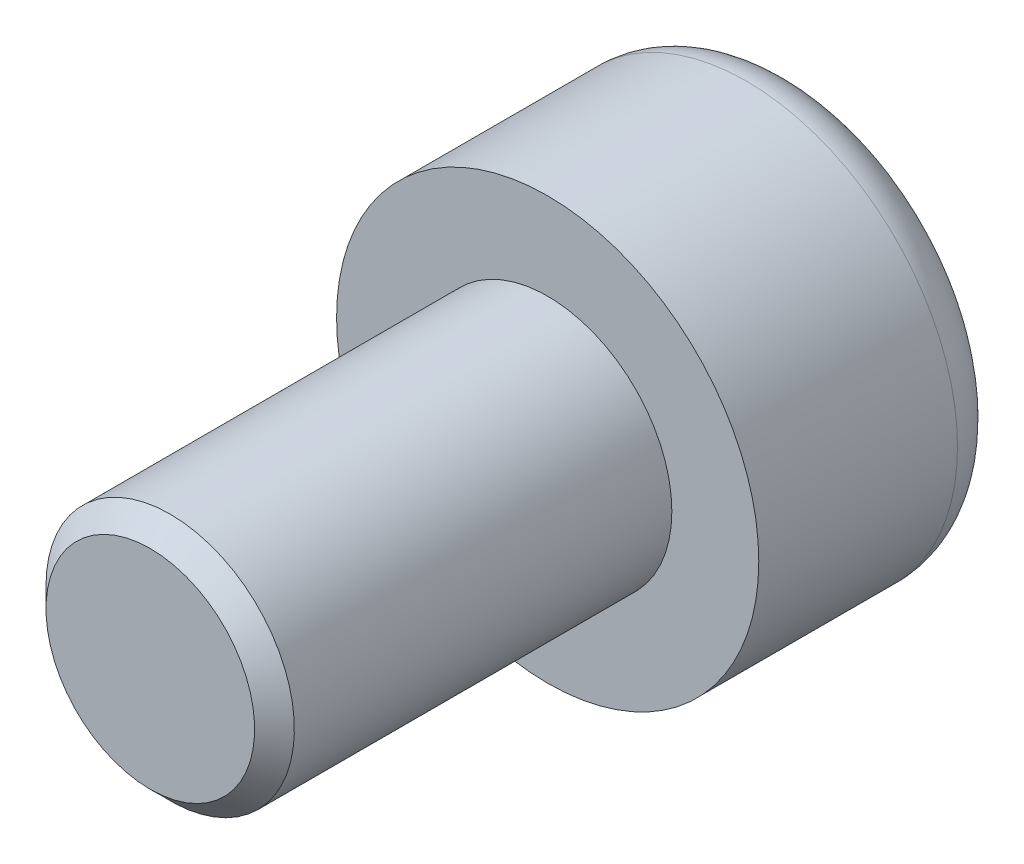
ISO-10303-21;
HEADER;
FILE_DESCRIPTION(('STEP AP214'),'2;1');
FILE_NAME('part.step','',(''),(''),'','','');
FILE_SCHEMA(('AUTOMOTIVE_DESIGN { 1 0 10303 214 1 1 1 1 }'));
ENDSEC;
DATA;
#1=APPLICATION_CONTEXT('core data for automotive mechanical design processes');
#2=APPLICATION_PROTOCOL_DEFINITION('international standard','automotive_design',2000,#1);
#3=PRODUCT_CONTEXT('',#1,'mechanical');
#4=PRODUCT('Part','Part','',(#3));
#5=PRODUCT_RELATED_PRODUCT_CATEGORY('part','',(#4));
#6=PRODUCT_DEFINITION_FORMATION('','',#4);
#7=PRODUCT_DEFINITION_CONTEXT('part definition',#1,'design');
#8=PRODUCT_DEFINITION('design','',#6,#7);
#9=PRODUCT_DEFINITION_SHAPE('','',#8);
#10=(LENGTH_UNIT() NAMED_UNIT(*) SI_UNIT(.MILLI.,.METRE.));
#11=(NAMED_UNIT(*) PLANE_ANGLE_UNIT() SI_UNIT($,.RADIAN.));
#12=(NAMED_UNIT(*) SI_UNIT($,.STERADIAN.) SOLID_ANGLE_UNIT());
#13=UNCERTAINTY_MEASURE_WITH_UNIT(LENGTH_MEASURE(1.E-05),#10,'distance_accuracy_value','');
#14=(GEOMETRIC_REPRESENTATION_CONTEXT(3) GLOBAL_UNCERTAINTY_ASSIGNED_CONTEXT((#13)) GLOBAL_UNIT_ASSIGNED_CONTEXT((#10,
#11,#12)) REPRESENTATION_CONTEXT('',''));
#15=CARTESIAN_POINT('',(0.,0.,0.));
#16=DIRECTION('',(0.,0.,1.));
#17=DIRECTION('',(1.,0.,0.));
#18=AXIS2_PLACEMENT_3D('',#15,#16,#17);
#19=CARTESIAN_POINT('',(-3.99999999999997,0.,3.125));
#20=DIRECTION('',(0.,0.,1.));
#21=DIRECTION('',(1.,0.,0.));
#22=AXIS2_PLACEMENT_3D('',#19,#20,#21);
#23=PLANE('',#22);
#24=DIRECTION('',(-0.866025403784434,0.500000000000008,0.));
#25=VECTOR('',#24,1.);
#26=CARTESIAN_POINT('',(0.,2.30940107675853,3.125));
#27=LINE('',#26,#25);
#28=CARTESIAN_POINT('',(0.,2.30940107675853,3.125));
#29=VERTEX_POINT('',#28);
#30=CARTESIAN_POINT('',(2.,1.15470053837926,3.125));
#31=VERTEX_POINT('',#30);
#32=EDGE_CURVE('E65',#29,#31,#27,.F.);
#33=ORIENTED_EDGE('',*,*,#32,.T.);
#34=DIRECTION('',(0.,1.,0.));
#35=VECTOR('',#34,1.);
#36=CARTESIAN_POINT('',(2.,1.15470053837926,3.125));
#37=LINE('',#36,#35);
#38=CARTESIAN_POINT('',(2.,-1.15470053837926,3.125));
#39=VERTEX_POINT('',#38);
#40=EDGE_CURVE('E62',#31,#39,#37,.F.);
#41=ORIENTED_EDGE('',*,*,#40,.T.);
#42=DIRECTION('',(0.866025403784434,0.500000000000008,0.));
#43=VECTOR('',#42,1.);
#44=CARTESIAN_POINT('',(2.,-1.15470053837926,3.125));
#45=LINE('',#44,#43);
#46=CARTESIAN_POINT('',(0.,-2.30940107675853,3.125));
#47=VERTEX_POINT('',#46);
#48=EDGE_CURVE('E59',#39,#47,#45,.F.);
#49=ORIENTED_EDGE('',*,*,#48,.T.);
#50=DIRECTION('',(0.866025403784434,-0.500000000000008,0.));
#51=VECTOR('',#50,1.);
#52=CARTESIAN_POINT('',(-2.,-1.15470053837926,3.125));
#53=LINE('',#52,#51);
#54=CARTESIAN_POINT('',(-2.,-1.15470053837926,3.125));
#55=VERTEX_POINT('',#54);
#56=EDGE_CURVE('E86',#47,#55,#53,.F.);
#57=ORIENTED_EDGE('',*,*,#56,.T.);
#58=DIRECTION('',(0.,1.,0.));
#59=VECTOR('',#58,1.);
#60=CARTESIAN_POINT('',(-2.,1.15470053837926,3.125));
#61=LINE('',#60,#59);
#62=CARTESIAN_POINT('',(-2.,1.15470053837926,3.125));
#63=VERTEX_POINT('',#62);
#64=EDGE_CURVE('E284',#55,#63,#61,.T.);
#65=ORIENTED_EDGE('',*,*,#64,.T.);
#66=DIRECTION('',(-0.866025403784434,-0.500000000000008,0.));
#67=VECTOR('',#66,1.);
#68=CARTESIAN_POINT('',(0.,2.30940107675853,3.125));
#69=LINE('',#68,#67);
#70=EDGE_CURVE('E291',#63,#29,#69,.F.);
#71=ORIENTED_EDGE('',*,*,#70,.T.);
#72=EDGE_LOOP('',(#33,#41,#49,#57,#65,#71));
#73=FACE_BOUND('',#72,.T.);
#74=ADVANCED_FACE('F16',(#73),#23,.F.);
#75=CARTESIAN_POINT('',(2.,1.15470053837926,3.125));
#76=DIRECTION('',(1.,0.,0.));
#77=DIRECTION('',(0.,0.,-1.));
#78=AXIS2_PLACEMENT_3D('',#75,#76,#77);
#79=PLANE('',#78);
#80=DIRECTION('',(0.,0.,1.));
#81=VECTOR('',#80,1.);
#82=CARTESIAN_POINT('',(2.,-1.15470053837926,3.125));
#83=LINE('',#82,#81);
#84=CARTESIAN_POINT('',(2.,-1.15470053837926,0.));
#85=VERTEX_POINT('',#84);
#86=EDGE_CURVE('E69',#85,#39,#83,.T.);
#87=ORIENTED_EDGE('',*,*,#86,.T.);
#88=ORIENTED_EDGE('',*,*,#40,.F.);
#89=DIRECTION('',(0.,0.,1.));
#90=VECTOR('',#89,1.);
#91=CARTESIAN_POINT('',(2.,1.15470053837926,3.125));
#92=LINE('',#91,#90);
#93=CARTESIAN_POINT('',(2.,1.15470053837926,0.));
#94=VERTEX_POINT('',#93);
#95=EDGE_CURVE('E122',#31,#94,#92,.F.);
#96=ORIENTED_EDGE('',*,*,#95,.T.);
#97=DIRECTION('',(0.,1.,0.));
#98=VECTOR('',#97,1.);
#99=CARTESIAN_POINT('',(2.,0.,0.));
#100=LINE('',#99,#98);
#101=EDGE_CURVE('E76',#94,#85,#100,.F.);
#102=ORIENTED_EDGE('',*,*,#101,.T.);
#103=EDGE_LOOP('',(#87,#88,#96,#102));
#104=FACE_BOUND('',#103,.T.);
#105=ADVANCED_FACE('F73',(#104),#79,.F.);
#106=CARTESIAN_POINT('',(2.,-1.15470053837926,3.125));
#107=DIRECTION('',(0.500000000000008,-0.866025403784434,0.));
#108=DIRECTION('',(0.866025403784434,0.500000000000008,0.));
#109=AXIS2_PLACEMENT_3D('',#106,#107,#108);
#110=PLANE('',#109);
#111=DIRECTION('',(0.,0.,1.));
#112=VECTOR('',#111,1.);
#113=CARTESIAN_POINT('',(0.,-2.30940107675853,3.125));
#114=LINE('',#113,#112);
#115=CARTESIAN_POINT('',(0.,-2.30940107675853,0.));
#116=VERTEX_POINT('',#115);
#117=EDGE_CURVE('E83',#116,#47,#114,.T.);
#118=ORIENTED_EDGE('',*,*,#117,.T.);
#119=ORIENTED_EDGE('',*,*,#48,.F.);
#120=ORIENTED_EDGE('',*,*,#86,.F.);
#121=DIRECTION('',(-0.866025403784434,-0.500000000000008,0.));
#122=VECTOR('',#121,1.);
#123=CARTESIAN_POINT('',(2.,-1.15470053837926,0.));
#124=LINE('',#123,#122);
#125=EDGE_CURVE('E120',#85,#116,#124,.T.);
#126=ORIENTED_EDGE('',*,*,#125,.T.);
#127=EDGE_LOOP('',(#118,#119,#120,#126));
#128=FACE_BOUND('',#127,.T.);
#129=ADVANCED_FACE('F81',(#128),#110,.F.);
#130=CARTESIAN_POINT('',(-2.,-1.15470053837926,3.125));
#131=DIRECTION('',(-0.500000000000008,-0.866025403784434,0.));
#132=DIRECTION('',(0.866025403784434,-0.500000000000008,0.));
#133=AXIS2_PLACEMENT_3D('',#130,#131,#132);
#134=PLANE('',#133);
#135=DIRECTION('',(0.,0.,1.));
#136=VECTOR('',#135,1.);
#137=CARTESIAN_POINT('',(-2.,-1.15470053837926,3.125));
#138=LINE('',#137,#136);
#139=CARTESIAN_POINT('',(-2.,-1.15470053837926,0.));
#140=VERTEX_POINT('',#139);
#141=EDGE_CURVE('E279',#140,#55,#138,.T.);
#142=ORIENTED_EDGE('',*,*,#141,.T.);
#143=ORIENTED_EDGE('',*,*,#56,.F.);
#144=ORIENTED_EDGE('',*,*,#117,.F.);
#145=DIRECTION('',(-0.866025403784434,0.500000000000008,0.));
#146=VECTOR('',#145,1.);
#147=CARTESIAN_POINT('',(0.,-2.30940107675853,0.));
#148=LINE('',#147,#146);
#149=EDGE_CURVE('E117',#116,#140,#148,.T.);
#150=ORIENTED_EDGE('',*,*,#149,.T.);
#151=EDGE_LOOP('',(#142,#143,#144,#150));
#152=FACE_BOUND('',#151,.T.);
#153=ADVANCED_FACE('F234',(#152),#134,.F.);
#154=CARTESIAN_POINT('',(-2.,1.15470053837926,3.125));
#155=DIRECTION('',(-1.,0.,0.));
#156=DIRECTION('',(0.,0.,1.));
#157=AXIS2_PLACEMENT_3D('',#154,#155,#156);
#158=PLANE('',#157);
#159=DIRECTION('',(0.,0.,1.));
#160=VECTOR('',#159,1.);
#161=CARTESIAN_POINT('',(-2.,1.15470053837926,3.125));
#162=LINE('',#161,#160);
#163=CARTESIAN_POINT('',(-2.,1.15470053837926,0.));
#164=VERTEX_POINT('',#163);
#165=EDGE_CURVE('E288',#164,#63,#162,.T.);
#166=ORIENTED_EDGE('',*,*,#165,.T.);
#167=ORIENTED_EDGE('',*,*,#64,.F.);
#168=ORIENTED_EDGE('',*,*,#141,.F.);
#169=DIRECTION('',(0.,1.,0.));
#170=VECTOR('',#169,1.);
#171=CARTESIAN_POINT('',(-2.,0.,0.));
#172=LINE('',#171,#170);
#173=EDGE_CURVE('E108',#140,#164,#172,.T.);
#174=ORIENTED_EDGE('',*,*,#173,.T.);
#175=EDGE_LOOP('',(#166,#167,#168,#174));
#176=FACE_BOUND('',#175,.T.);
#177=ADVANCED_FACE('F224',(#176),#158,.F.);
#178=CARTESIAN_POINT('',(0.,2.30940107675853,3.125));
#179=DIRECTION('',(-0.500000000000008,0.866025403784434,0.));
#180=DIRECTION('',(-0.866025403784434,-0.500000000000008,0.));
#181=AXIS2_PLACEMENT_3D('',#178,#179,#180);
#182=PLANE('',#181);
#183=DIRECTION('',(0.,0.,1.));
#184=VECTOR('',#183,1.);
#185=CARTESIAN_POINT('',(0.,2.30940107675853,3.125));
#186=LINE('',#185,#184);
#187=CARTESIAN_POINT('',(0.,2.30940107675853,0.));
#188=VERTEX_POINT('',#187);
#189=EDGE_CURVE('E295',#188,#29,#186,.T.);
#190=ORIENTED_EDGE('',*,*,#189,.T.);
#191=ORIENTED_EDGE('',*,*,#70,.F.);
#192=ORIENTED_EDGE('',*,*,#165,.F.);
#193=DIRECTION('',(0.866025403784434,0.500000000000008,0.));
#194=VECTOR('',#193,1.);
#195=CARTESIAN_POINT('',(-2.,1.15470053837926,0.));
#196=LINE('',#195,#194);
#197=EDGE_CURVE('E102',#164,#188,#196,.T.);
#198=ORIENTED_EDGE('',*,*,#197,.T.);
#199=EDGE_LOOP('',(#190,#191,#192,#198));
#200=FACE_BOUND('',#199,.T.);
#201=ADVANCED_FACE('F163',(#200),#182,.F.);
#202=CARTESIAN_POINT('',(0.,2.30940107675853,3.125));
#203=DIRECTION('',(0.500000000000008,0.866025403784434,0.));
#204=DIRECTION('',(-0.866025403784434,0.500000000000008,0.));
#205=AXIS2_PLACEMENT_3D('',#202,#203,#204);
#206=PLANE('',#205);
#207=ORIENTED_EDGE('',*,*,#95,.F.);
#208=ORIENTED_EDGE('',*,*,#32,.F.);
#209=ORIENTED_EDGE('',*,*,#189,.F.);
#210=DIRECTION('',(0.866025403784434,-0.500000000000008,0.));
#211=VECTOR('',#210,1.);
#212=CARTESIAN_POINT('',(0.,2.30940107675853,0.));
#213=LINE('',#212,#211);
#214=EDGE_CURVE('E100',#188,#94,#213,.T.);
#215=ORIENTED_EDGE('',*,*,#214,.T.);
#216=EDGE_LOOP('',(#207,#208,#209,#215));
#217=FACE_BOUND('',#216,.T.);
#218=ADVANCED_FACE('F157',(#217),#206,.F.);
#219=CARTESIAN_POINT('',(0.,0.,0.));
#220=DIRECTION('',(0.,0.,1.));
#221=DIRECTION('',(1.,0.,0.));
#222=AXIS2_PLACEMENT_3D('',#219,#220,#221);
#223=PLANE('',#222);
#224=ORIENTED_EDGE('',*,*,#197,.F.);
#225=ORIENTED_EDGE('',*,*,#173,.F.);
#226=ORIENTED_EDGE('',*,*,#149,.F.);
#227=ORIENTED_EDGE('',*,*,#125,.F.);
#228=ORIENTED_EDGE('',*,*,#101,.F.);
#229=ORIENTED_EDGE('',*,*,#214,.F.);
#230=EDGE_LOOP('',(#224,#225,#226,#227,#228,#229));
#231=FACE_BOUND('',#230,.T.);
#232=CARTESIAN_POINT('',(0.,0.,0.));
#233=DIRECTION('',(0.,0.,1.));
#234=DIRECTION('',(1.,0.,0.));
#235=AXIS2_PLACEMENT_3D('',#232,#233,#234);
#236=CIRCLE('',#235,3.25);
#237=CARTESIAN_POINT('',(3.25,0.,0.));
#238=VERTEX_POINT('',#237);
#239=CARTESIAN_POINT('',(-3.25,0.,0.));
#240=VERTEX_POINT('',#239);
#241=EDGE_CURVE('E98',#238,#240,#236,.T.);
#242=ORIENTED_EDGE('',*,*,#241,.F.);
#243=CARTESIAN_POINT('',(0.,0.,0.));
#244=DIRECTION('',(0.,0.,1.));
#245=DIRECTION('',(-1.,0.,0.));
#246=AXIS2_PLACEMENT_3D('',#243,#244,#245);
#247=CIRCLE('',#246,3.25);
#248=EDGE_CURVE('E35',#240,#238,#247,.T.);
#249=ORIENTED_EDGE('',*,*,#248,.F.);
#250=EDGE_LOOP('',(#242,#249));
#251=FACE_BOUND('',#250,.T.);
#252=ADVANCED_FACE('F138',(#231,#251),#223,.F.);
#253=CARTESIAN_POINT('',(0.,0.,1.));
#254=DIRECTION('',(0.,0.,1.));
#255=DIRECTION('',(1.,0.,0.));
#256=AXIS2_PLACEMENT_3D('',#253,#254,#255);
#257=TOROIDAL_SURFACE('',#256,3.25,1.);
#258=CARTESIAN_POINT('',(0.,0.,1.));
#259=DIRECTION('',(0.,0.,-1.));
#260=DIRECTION('',(-1.,0.,0.));
#261=AXIS2_PLACEMENT_3D('',#258,#259,#260);
#262=CIRCLE('',#261,4.25);
#263=CARTESIAN_POINT('',(-4.25,0.,1.));
#264=VERTEX_POINT('',#263);
#265=EDGE_CURVE('E95',#264,#264,#262,.F.);
#266=ORIENTED_EDGE('',*,*,#265,.F.);
#267=EDGE_LOOP('',(#266));
#268=FACE_BOUND('',#267,.T.);
#269=ORIENTED_EDGE('',*,*,#241,.T.);
#270=ORIENTED_EDGE('',*,*,#248,.T.);
#271=EDGE_LOOP('',(#269,#270));
#272=FACE_BOUND('',#271,.T.);
#273=ADVANCED_FACE('F97',(#268,#272),#257,.T.);
#274=CARTESIAN_POINT('',(0.,0.,13.));
#275=DIRECTION('',(0.,0.,1.));
#276=DIRECTION('',(1.,0.,0.));
#277=AXIS2_PLACEMENT_3D('',#274,#275,#276);
#278=PLANE('',#277);
#279=CARTESIAN_POINT('',(0.,0.,12.9999999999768));
#280=DIRECTION('',(0.,0.,-1.));
#281=DIRECTION('',(0.,1.,0.));
#282=AXIS2_PLACEMENT_3D('',#279,#280,#281);
#283=CIRCLE('',#282,2.09999999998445);
#284=CARTESIAN_POINT('',(0.,2.09999999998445,12.9999999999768));
#285=VERTEX_POINT('',#284);
#286=EDGE_CURVE('E93',#285,#285,#283,.T.);
#287=ORIENTED_EDGE('',*,*,#286,.F.);
#288=EDGE_LOOP('',(#287));
#289=FACE_BOUND('',#288,.T.);
#290=ADVANCED_FACE('F137',(#289),#278,.T.);
#291=CARTESIAN_POINT('',(0.,0.,5.));
#292=DIRECTION('',(0.,0.,-1.));
#293=DIRECTION('',(-1.,0.,0.));
#294=AXIS2_PLACEMENT_3D('',#291,#292,#293);
#295=CYLINDRICAL_SURFACE('',#294,4.25);
#296=ORIENTED_EDGE('',*,*,#265,.T.);
#297=EDGE_LOOP('',(#296));
#298=FACE_BOUND('',#297,.T.);
#299=CARTESIAN_POINT('',(0.,0.,5.));
#300=DIRECTION('',(0.,0.,-1.));
#301=DIRECTION('',(-1.,0.,0.));
#302=AXIS2_PLACEMENT_3D('',#299,#300,#301);
#303=CIRCLE('',#302,4.25);
#304=CARTESIAN_POINT('',(-4.25,0.,5.));
#305=VERTEX_POINT('',#304);
#306=EDGE_CURVE('E90',#305,#305,#303,.F.);
#307=ORIENTED_EDGE('',*,*,#306,.F.);
#308=EDGE_LOOP('',(#307));
#309=FACE_BOUND('',#308,.T.);
#310=ADVANCED_FACE('F179',(#298,#309),#295,.T.);
#311=CARTESIAN_POINT('',(0.,0.,12.6000000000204));
#312=DIRECTION('',(0.,0.,-1.));
#313=DIRECTION('',(0.,1.,0.));
#314=AXIS2_PLACEMENT_3D('',#311,#312,#313);
#315=CONICAL_SURFACE('',#314,2.49999999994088,0.785398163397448);
#316=CARTESIAN_POINT('',(0.,0.,12.6));
#317=DIRECTION('',(0.,0.,-1.));
#318=DIRECTION('',(-1.,0.,0.));
#319=AXIS2_PLACEMENT_3D('',#316,#317,#318);
#320=CIRCLE('',#319,2.5);
#321=CARTESIAN_POINT('',(-2.5,0.,12.6));
#322=VERTEX_POINT('',#321);
#323=EDGE_CURVE('E27',#322,#322,#320,.T.);
#324=ORIENTED_EDGE('',*,*,#323,.F.);
#325=EDGE_LOOP('',(#324));
#326=FACE_BOUND('',#325,.T.);
#327=ORIENTED_EDGE('',*,*,#286,.T.);
#328=EDGE_LOOP('',(#327));
#329=FACE_BOUND('',#328,.T.);
#330=ADVANCED_FACE('F173',(#326,#329),#315,.T.);
#331=CARTESIAN_POINT('',(0.,0.,5.));
#332=DIRECTION('',(0.,0.,1.));
#333=DIRECTION('',(1.,0.,0.));
#334=AXIS2_PLACEMENT_3D('',#331,#332,#333);
#335=PLANE('',#334);
#336=CARTESIAN_POINT('',(0.,0.,5.));
#337=DIRECTION('',(0.,0.,-1.));
#338=DIRECTION('',(-1.,0.,0.));
#339=AXIS2_PLACEMENT_3D('',#336,#337,#338);
#340=CIRCLE('',#339,2.5);
#341=CARTESIAN_POINT('',(-2.5,0.,5.));
#342=VERTEX_POINT('',#341);
#343=EDGE_CURVE('E11',#342,#342,#340,.F.);
#344=ORIENTED_EDGE('',*,*,#343,.F.);
#345=EDGE_LOOP('',(#344));
#346=FACE_BOUND('',#345,.T.);
#347=ORIENTED_EDGE('',*,*,#306,.T.);
#348=EDGE_LOOP('',(#347));
#349=FACE_BOUND('',#348,.T.);
#350=ADVANCED_FACE('F167',(#346,#349),#335,.T.);
#351=CARTESIAN_POINT('',(0.,0.,13.));
#352=DIRECTION('',(0.,0.,-1.));
#353=DIRECTION('',(-1.,0.,0.));
#354=AXIS2_PLACEMENT_3D('',#351,#352,#353);
#355=CYLINDRICAL_SURFACE('',#354,2.5);
#356=ORIENTED_EDGE('',*,*,#343,.T.);
#357=EDGE_LOOP('',(#356));
#358=FACE_BOUND('',#357,.T.);
#359=ORIENTED_EDGE('',*,*,#323,.T.);
#360=EDGE_LOOP('',(#359));
#361=FACE_BOUND('',#360,.T.);
#362=ADVANCED_FACE('F165',(#358,#361),#355,.T.);
#363=CLOSED_SHELL('',(#74,#105,#129,#153,#177,#201,#218,#252,#273,#290,#310,#330,#350,#362));
#364=MANIFOLD_SOLID_BREP('B1',#363);
#365=ADVANCED_BREP_SHAPE_REPRESENTATION('',(#18,#364),#14);
#366=SHAPE_DEFINITION_REPRESENTATION(#9,#365);
ENDSEC;
END-ISO-10303-21;
